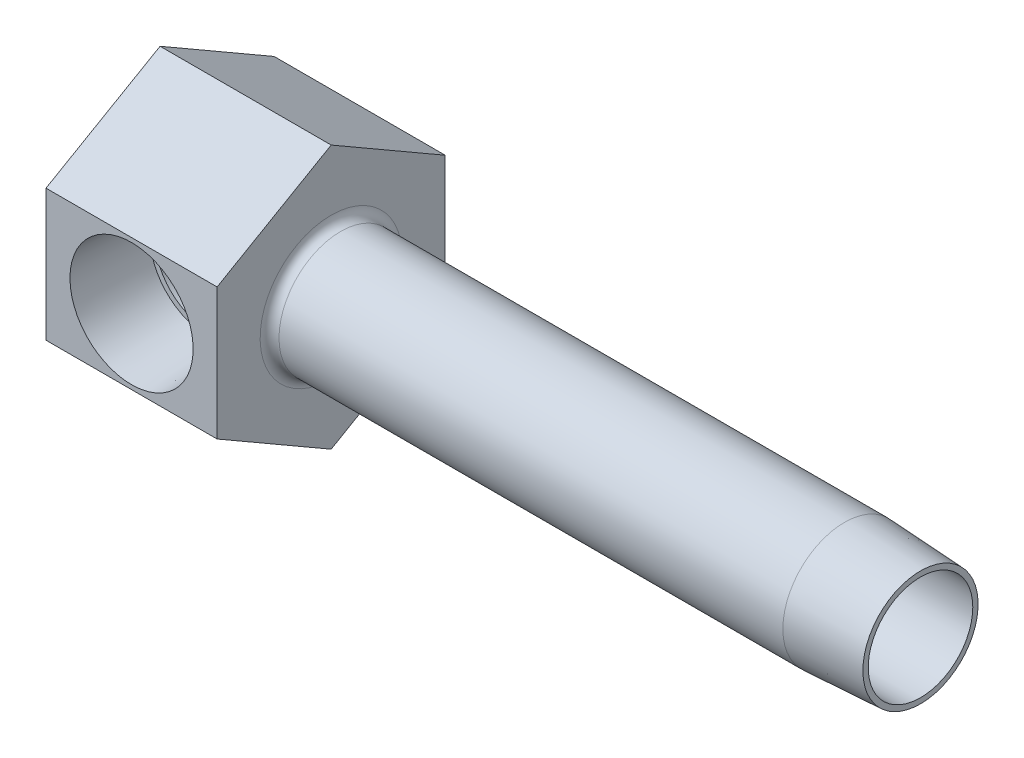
ISO-10303-21;
HEADER;
FILE_DESCRIPTION(('STEP AP214'),'2;1');
FILE_NAME('part.step','',(''),(''),'','','');
FILE_SCHEMA(('AUTOMOTIVE_DESIGN { 1 0 10303 214 1 1 1 1 }'));
ENDSEC;
DATA;
#1=APPLICATION_CONTEXT('core data for automotive mechanical design processes');
#2=APPLICATION_PROTOCOL_DEFINITION('international standard','automotive_design',2000,#1);
#3=PRODUCT_CONTEXT('',#1,'mechanical');
#4=PRODUCT('Part','Part','',(#3));
#5=PRODUCT_RELATED_PRODUCT_CATEGORY('part','',(#4));
#6=PRODUCT_DEFINITION_FORMATION('','',#4);
#7=PRODUCT_DEFINITION_CONTEXT('part definition',#1,'design');
#8=PRODUCT_DEFINITION('design','',#6,#7);
#9=PRODUCT_DEFINITION_SHAPE('','',#8);
#10=(LENGTH_UNIT() NAMED_UNIT(*) SI_UNIT(.MILLI.,.METRE.));
#11=(NAMED_UNIT(*) PLANE_ANGLE_UNIT() SI_UNIT($,.RADIAN.));
#12=(NAMED_UNIT(*) SI_UNIT($,.STERADIAN.) SOLID_ANGLE_UNIT());
#13=UNCERTAINTY_MEASURE_WITH_UNIT(LENGTH_MEASURE(1.E-05),#10,'distance_accuracy_value','');
#14=(GEOMETRIC_REPRESENTATION_CONTEXT(3) GLOBAL_UNCERTAINTY_ASSIGNED_CONTEXT((#13)) GLOBAL_UNIT_ASSIGNED_CONTEXT((#10,
#11,#12)) REPRESENTATION_CONTEXT('',''));
#15=CARTESIAN_POINT('',(0.,0.,0.));
#16=DIRECTION('',(0.,0.,1.));
#17=DIRECTION('',(1.,0.,0.));
#18=AXIS2_PLACEMENT_3D('',#15,#16,#17);
#19=CARTESIAN_POINT('',(63.5,0.,4.71428939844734));
#20=DIRECTION('',(-1.,0.,0.));
#21=DIRECTION('',(0.,0.,1.));
#22=AXIS2_PLACEMENT_3D('',#19,#20,#21);
#23=PLANE('',#22);
#24=CARTESIAN_POINT('',(63.5,0.,9.525));
#25=DIRECTION('',(-1.,0.,0.));
#26=DIRECTION('',(0.,0.,1.));
#27=AXIS2_PLACEMENT_3D('',#24,#25,#26);
#28=CIRCLE('',#27,4.81071060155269);
#29=CARTESIAN_POINT('',(63.5,0.,14.3357106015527));
#30=VERTEX_POINT('',#29);
#31=EDGE_CURVE('E230',#30,#30,#28,.T.);
#32=ORIENTED_EDGE('',*,*,#31,.F.);
#33=EDGE_LOOP('',(#32));
#34=FACE_BOUND('',#33,.T.);
#35=CARTESIAN_POINT('',(63.5,0.,9.525));
#36=DIRECTION('',(1.,0.,0.));
#37=DIRECTION('',(0.,0.,-1.));
#38=AXIS2_PLACEMENT_3D('',#35,#36,#37);
#39=CIRCLE('',#38,4.365625);
#40=CARTESIAN_POINT('',(63.5,0.,5.159375));
#41=VERTEX_POINT('',#40);
#42=EDGE_CURVE('E133',#41,#41,#39,.T.);
#43=ORIENTED_EDGE('',*,*,#42,.F.);
#44=EDGE_LOOP('',(#43));
#45=FACE_BOUND('',#44,.T.);
#46=ADVANCED_FACE('F15',(#34,#45),#23,.F.);
#47=CARTESIAN_POINT('',(7.14375,0.,19.05));
#48=DIRECTION('',(0.,0.,1.));
#49=DIRECTION('',(1.,0.,0.));
#50=AXIS2_PLACEMENT_3D('',#47,#48,#49);
#51=CONICAL_SURFACE('',#50,5.1435,0.0523598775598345);
#52=CARTESIAN_POINT('',(7.14375,0.,19.05));
#53=DIRECTION('',(0.,0.,-1.));
#54=DIRECTION('',(-1.,0.,0.));
#55=AXIS2_PLACEMENT_3D('',#52,#53,#54);
#56=CIRCLE('',#55,5.1435);
#57=CARTESIAN_POINT('',(2.00025,0.,19.05));
#58=VERTEX_POINT('',#57);
#59=EDGE_CURVE('E290',#58,#58,#56,.T.);
#60=ORIENTED_EDGE('',*,*,#59,.F.);
#61=EDGE_LOOP('',(#60));
#62=FACE_BOUND('',#61,.T.);
#63=CARTESIAN_POINT('',(7.14375,0.,12.7000000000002));
#64=DIRECTION('',(0.,0.,-1.));
#65=DIRECTION('',(-1.,0.,0.));
#66=AXIS2_PLACEMENT_3D('',#63,#64,#65);
#67=CIRCLE('',#66,4.81071060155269);
#68=CARTESIAN_POINT('',(10.9073758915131,-2.99634054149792,12.7000000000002));
#69=VERTEX_POINT('',#68);
#70=CARTESIAN_POINT('',(10.9073758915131,2.99634054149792,12.7000000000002));
#71=VERTEX_POINT('',#70);
#72=EDGE_CURVE('E294',#69,#71,#67,.T.);
#73=ORIENTED_EDGE('',*,*,#72,.T.);
#74=CARTESIAN_POINT('',(10.9071937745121,2.99655245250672,12.6998000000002));
#75=CARTESIAN_POINT('',(10.971635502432,2.92155827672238,12.7705639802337));
#76=CARTESIAN_POINT('',(11.0345784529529,2.84341410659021,12.8393139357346));
#77=CARTESIAN_POINT('',(11.1569073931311,2.68056902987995,12.9723675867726));
#78=CARTESIAN_POINT('',(11.2162880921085,2.59585877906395,13.0366646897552));
#79=CARTESIAN_POINT('',(11.3887731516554,2.33059710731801,13.2228141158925));
#80=CARTESIAN_POINT('',(11.4952955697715,2.13996459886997,13.3369144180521));
#81=CARTESIAN_POINT('',(11.6670238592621,1.76978922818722,13.520146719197));
#82=CARTESIAN_POINT('',(11.7362081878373,1.59429861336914,13.5936668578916));
#83=CARTESIAN_POINT('',(11.8243838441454,1.32069459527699,13.6871793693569));
#84=CARTESIAN_POINT('',(11.8511557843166,1.22786736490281,13.7155347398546));
#85=CARTESIAN_POINT('',(11.8990876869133,1.0391950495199,13.7662595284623));
#86=CARTESIAN_POINT('',(11.9202500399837,0.943351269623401,13.7886314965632));
#87=CARTESIAN_POINT('',(11.9566990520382,0.748466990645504,13.8271421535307));
#88=CARTESIAN_POINT('',(11.971935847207,0.649406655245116,13.8432279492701));
#89=CARTESIAN_POINT('',(11.9959472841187,0.449682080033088,13.8685692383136));
#90=CARTESIAN_POINT('',(12.0047249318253,0.349018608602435,13.8778279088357));
#91=CARTESIAN_POINT('',(12.0156291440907,0.146869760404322,13.8893288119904));
#92=CARTESIAN_POINT('',(12.0177517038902,0.0453839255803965,13.8915668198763));
#93=CARTESIAN_POINT('',(12.0152840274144,-0.157407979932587,13.8889645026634));
#94=CARTESIAN_POINT('',(12.0106943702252,-0.258714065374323,13.8841247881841));
#95=CARTESIAN_POINT('',(11.9957865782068,-0.449057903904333,13.8683984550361));
#96=CARTESIAN_POINT('',(11.9861593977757,-0.538211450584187,13.8582411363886));
#97=CARTESIAN_POINT('',(11.961864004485,-0.715062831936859,13.8325939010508));
#98=CARTESIAN_POINT('',(11.9471941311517,-0.802760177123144,13.8171022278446));
#99=CARTESIAN_POINT('',(11.8959888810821,-1.06271154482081,13.762990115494));
#100=CARTESIAN_POINT('',(11.8522396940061,-1.23204639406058,13.7167134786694));
#101=CARTESIAN_POINT('',(11.7458224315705,-1.56656708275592,13.6038703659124));
#102=CARTESIAN_POINT('',(11.6823922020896,-1.73122409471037,13.5364852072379));
#103=CARTESIAN_POINT('',(11.5406571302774,-2.04618319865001,13.3853583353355));
#104=CARTESIAN_POINT('',(11.4623317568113,-2.19646504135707,13.3015940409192));
#105=CARTESIAN_POINT('',(11.3067680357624,-2.45998630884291,13.1343941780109));
#106=CARTESIAN_POINT('',(11.2311482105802,-2.57539375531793,13.0528153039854));
#107=CARTESIAN_POINT('',(11.0735639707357,-2.79452635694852,12.8818550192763));
#108=CARTESIAN_POINT('',(10.9916301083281,-2.89830245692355,12.792510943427));
#109=CARTESIAN_POINT('',(10.9071937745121,-2.99655245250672,12.6998000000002));
#110=B_SPLINE_CURVE_WITH_KNOTS('',3,(#74,#75,#76,#77,#78,#79,#80,#81,#82,#83,#84,#85,#86,#87,
#88,#89,#90,#91,#92,#93,#94,#95,#96,#97,#98,#99,#100,#101,#102,#103,#104,#105,#106,#107,#108,
#109),.UNSPECIFIED.,.F.,.F.,(4,2,2,2,2,2,2,2,2,2,2,2,2,2,2,2,2,4),(0.,0.364634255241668,
0.72979730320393,1.46525067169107,2.06997219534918,2.37170467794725,2.67330836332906,
2.97739780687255,3.28134564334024,3.58547634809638,3.88958081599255,4.15999530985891,
4.43049893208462,4.97084503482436,5.53548493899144,6.10090884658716,6.58103480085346,
7.05896806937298),.UNSPECIFIED.);
#111=EDGE_CURVE('E122',#71,#69,#110,.T.);
#112=ORIENTED_EDGE('',*,*,#111,.T.);
#113=EDGE_LOOP('',(#73,#112));
#114=FACE_BOUND('',#113,.T.);
#115=ADVANCED_FACE('F139',(#62,#114),#51,.F.);
#116=CARTESIAN_POINT('',(11.9544606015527,0.,12.7000000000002));
#117=DIRECTION('',(0.,0.,1.));
#118=DIRECTION('',(1.,0.,0.));
#119=AXIS2_PLACEMENT_3D('',#116,#117,#118);
#120=PLANE('',#119);
#121=ORIENTED_EDGE('',*,*,#72,.F.);
#122=DIRECTION('',(1.,0.,0.));
#123=VECTOR('',#122,1.);
#124=CARTESIAN_POINT('',(66.1375087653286,-2.99634054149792,12.7000000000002));
#125=LINE('',#124,#123);
#126=CARTESIAN_POINT('',(10.3187500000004,-2.99634054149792,12.7000000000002));
#127=VERTEX_POINT('',#126);
#128=EDGE_CURVE('E119',#69,#127,#125,.F.);
#129=ORIENTED_EDGE('',*,*,#128,.T.);
#130=CARTESIAN_POINT('',(7.14375,0.,12.7000000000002));
#131=DIRECTION('',(0.,0.,-1.));
#132=DIRECTION('',(-1.,0.,0.));
#133=AXIS2_PLACEMENT_3D('',#130,#131,#132);
#134=CIRCLE('',#133,4.36562500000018);
#135=CARTESIAN_POINT('',(10.3187500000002,2.99634054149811,12.7000000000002));
#136=VERTEX_POINT('',#135);
#137=EDGE_CURVE('E118',#127,#136,#134,.T.);
#138=ORIENTED_EDGE('',*,*,#137,.T.);
#139=DIRECTION('',(1.,0.,0.));
#140=VECTOR('',#139,1.);
#141=CARTESIAN_POINT('',(66.1375087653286,2.99634054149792,12.7000000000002));
#142=LINE('',#141,#140);
#143=EDGE_CURVE('E125',#136,#71,#142,.T.);
#144=ORIENTED_EDGE('',*,*,#143,.T.);
#145=EDGE_LOOP('',(#121,#129,#138,#144));
#146=FACE_BOUND('',#145,.T.);
#147=ADVANCED_FACE('F147',(#146),#120,.T.);
#148=CARTESIAN_POINT('',(7.14375,0.,35.9059426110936));
#149=DIRECTION('',(0.,0.,-1.));
#150=DIRECTION('',(-1.,0.,0.));
#151=AXIS2_PLACEMENT_3D('',#148,#149,#150);
#152=CYLINDRICAL_SURFACE('',#151,4.36562500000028);
#153=ORIENTED_EDGE('',*,*,#137,.F.);
#154=CARTESIAN_POINT('',(7.14375,0.,9.525));
#155=DIRECTION('',(0.707106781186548,0.,-0.707106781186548));
#156=DIRECTION('',(-0.707106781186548,0.,-0.707106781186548));
#157=AXIS2_PLACEMENT_3D('',#154,#155,#156);
#158=ELLIPSE('',#157,6.17392608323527,4.36562500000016);
#159=CARTESIAN_POINT('',(7.14375,-4.3656250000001,9.525));
#160=VERTEX_POINT('',#159);
#161=EDGE_CURVE('E104',#127,#160,#158,.T.);
#162=ORIENTED_EDGE('',*,*,#161,.T.);
#163=CARTESIAN_POINT('',(7.14375,0.,9.525));
#164=DIRECTION('',(-0.707106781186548,0.,-0.707106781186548));
#165=DIRECTION('',(0.707106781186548,0.,-0.707106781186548));
#166=AXIS2_PLACEMENT_3D('',#163,#164,#165);
#167=ELLIPSE('',#166,6.17392608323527,4.36562500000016);
#168=CARTESIAN_POINT('',(8.98888023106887,-3.95653586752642,7.67986976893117));
#169=VERTEX_POINT('',#168);
#170=EDGE_CURVE('E100',#160,#169,#167,.F.);
#171=ORIENTED_EDGE('',*,*,#170,.T.);
#172=CARTESIAN_POINT('',(7.14375,0.,7.67986976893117));
#173=DIRECTION('',(0.,0.,-1.));
#174=DIRECTION('',(-1.,0.,0.));
#175=AXIS2_PLACEMENT_3D('',#172,#173,#174);
#176=CIRCLE('',#175,4.36562500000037);
#177=CARTESIAN_POINT('',(8.98888023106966,3.95653586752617,7.67986976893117));
#178=VERTEX_POINT('',#177);
#179=EDGE_CURVE('E112',#169,#178,#176,.T.);
#180=ORIENTED_EDGE('',*,*,#179,.T.);
#181=CARTESIAN_POINT('',(7.14375,4.3656250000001,9.525));
#182=VERTEX_POINT('',#181);
#183=EDGE_CURVE('E30',#178,#182,#167,.F.);
#184=ORIENTED_EDGE('',*,*,#183,.T.);
#185=EDGE_CURVE('E121',#182,#136,#158,.T.);
#186=ORIENTED_EDGE('',*,*,#185,.T.);
#187=EDGE_LOOP('',(#153,#162,#171,#180,#184,#186));
#188=FACE_BOUND('',#187,.T.);
#189=ADVANCED_FACE('F115',(#188),#152,.F.);
#190=CARTESIAN_POINT('',(7.14375,0.,7.67986976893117));
#191=DIRECTION('',(0.,0.,1.));
#192=DIRECTION('',(1.,0.,0.));
#193=AXIS2_PLACEMENT_3D('',#190,#191,#192);
#194=CONICAL_SURFACE('',#193,4.36562500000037,1.0471975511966);
#195=ORIENTED_EDGE('',*,*,#179,.F.);
#196=CARTESIAN_POINT('',(8.9894997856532,-3.95662913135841,7.68006976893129));
#197=CARTESIAN_POINT('',(8.91497560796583,-3.94541760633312,7.6560189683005));
#198=CARTESIAN_POINT('',(8.84020256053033,-3.93428272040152,7.6327193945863));
#199=CARTESIAN_POINT('',(8.69001846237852,-3.91242782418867,7.58793860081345));
#200=CARTESIAN_POINT('',(8.61460714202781,-3.90170800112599,7.56645819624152));
#201=CARTESIAN_POINT('',(8.38848524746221,-3.87074056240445,7.50556917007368));
#202=CARTESIAN_POINT('',(8.2367287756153,-3.8515020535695,7.46932807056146));
#203=CARTESIAN_POINT('',(8.00667896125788,-3.82676825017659,7.42384959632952));
#204=CARTESIAN_POINT('',(7.92948623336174,-3.81920348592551,7.41015805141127));
#205=CARTESIAN_POINT('',(7.77441965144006,-3.80585437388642,7.38622945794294));
#206=CARTESIAN_POINT('',(7.69654594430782,-3.80006965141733,7.37599168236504));
#207=CARTESIAN_POINT('',(7.53967894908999,-3.79060206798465,7.35933225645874));
#208=CARTESIAN_POINT('',(7.46068163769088,-3.78693482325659,7.35293894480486));
#209=CARTESIAN_POINT('',(7.30231301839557,-3.7819879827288,7.34434534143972));
#210=CARTESIAN_POINT('',(7.2229414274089,-3.78071064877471,7.34214902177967));
#211=CARTESIAN_POINT('',(7.14355,-3.78074215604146,7.34218750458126));
#212=B_SPLINE_CURVE_WITH_KNOTS('',3,(#196,#197,#198,#199,#200,#201,#202,#203,#204,#205,#206,
#207,#208,#209,#210,#211),.UNSPECIFIED.,.F.,.F.,(4,2,2,2,2,2,2,4),(0.,0.237303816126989,
0.474713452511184,0.945835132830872,1.18204117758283,1.41819746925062,1.65607385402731,
1.89417525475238),.UNSPECIFIED.);
#213=CARTESIAN_POINT('',(7.14375,-3.78074215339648,7.34218750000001));
#214=VERTEX_POINT('',#213);
#215=EDGE_CURVE('E108',#169,#214,#212,.T.);
#216=ORIENTED_EDGE('',*,*,#215,.T.);
#217=DIRECTION('',(0.,0.866025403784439,-0.5));
#218=VECTOR('',#217,1.);
#219=CARTESIAN_POINT('',(7.14375,0.,5.159375));
#220=LINE('',#219,#218);
#221=CARTESIAN_POINT('',(7.14375,0.,5.159375));
#222=VERTEX_POINT('',#221);
#223=EDGE_CURVE('E275',#214,#222,#220,.T.);
#224=ORIENTED_EDGE('',*,*,#223,.T.);
#225=DIRECTION('',(0.,0.866025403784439,0.5));
#226=VECTOR('',#225,1.);
#227=CARTESIAN_POINT('',(7.14375,0.,5.159375));
#228=LINE('',#227,#226);
#229=CARTESIAN_POINT('',(7.14375,3.78074215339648,7.34218750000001));
#230=VERTEX_POINT('',#229);
#231=EDGE_CURVE('E258',#222,#230,#228,.T.);
#232=ORIENTED_EDGE('',*,*,#231,.T.);
#233=CARTESIAN_POINT('',(7.14355,3.78074215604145,7.34218750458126));
#234=CARTESIAN_POINT('',(7.20515303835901,3.78073202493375,7.34217451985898));
#235=CARTESIAN_POINT('',(7.26674694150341,3.78149280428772,7.34348695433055));
#236=CARTESIAN_POINT('',(7.38976236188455,3.78448017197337,7.34867189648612));
#237=CARTESIAN_POINT('',(7.45118394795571,3.78670605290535,7.3525431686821));
#238=CARTESIAN_POINT('',(7.63466542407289,3.79545033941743,7.36782927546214));
#239=CARTESIAN_POINT('',(7.75632841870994,3.80403629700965,7.38291749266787));
#240=CARTESIAN_POINT('',(8.11659337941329,3.83592256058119,7.44024735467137));
#241=CARTESIAN_POINT('',(8.35266311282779,3.8653919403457,7.49460284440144));
#242=CARTESIAN_POINT('',(8.65303625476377,3.90716169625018,7.57737916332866));
#243=CARTESIAN_POINT('',(8.72054620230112,3.91683509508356,7.59689306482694));
#244=CARTESIAN_POINT('',(8.855265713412,3.93652410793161,7.63741882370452));
#245=CARTESIAN_POINT('',(8.92247399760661,3.94654056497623,7.65843453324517));
#246=CARTESIAN_POINT('',(8.9894997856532,3.9566291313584,7.68006976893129));
#247=B_SPLINE_CURVE_WITH_KNOTS('',3,(#233,#234,#235,#236,#237,#238,#239,#240,#241,#242,#243,
#244,#245,#246),.UNSPECIFIED.,.F.,.F.,(4,2,2,2,2,2,4),(0.,0.184774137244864,0.369459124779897,
0.73767480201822,1.46761028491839,1.68043381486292,1.89382432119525),.UNSPECIFIED.);
#248=EDGE_CURVE('E251',#230,#178,#247,.T.);
#249=ORIENTED_EDGE('',*,*,#248,.T.);
#250=EDGE_LOOP('',(#195,#216,#224,#232,#249));
#251=FACE_BOUND('',#250,.T.);
#252=ADVANCED_FACE('F174',(#251),#194,.F.);
#253=CARTESIAN_POINT('',(14.2875,5.4992613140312,19.05));
#254=DIRECTION('',(0.,0.,-1.));
#255=DIRECTION('',(-1.,0.,0.));
#256=AXIS2_PLACEMENT_3D('',#253,#254,#255);
#257=PLANE('',#256);
#258=DIRECTION('',(0.,-1.,0.));
#259=VECTOR('',#258,1.);
#260=CARTESIAN_POINT('',(0.,5.4992613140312,19.05));
#261=LINE('',#260,#259);
#262=CARTESIAN_POINT('',(0.,5.4992613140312,19.05));
#263=VERTEX_POINT('',#262);
#264=CARTESIAN_POINT('',(0.,-5.49926131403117,19.05));
#265=VERTEX_POINT('',#264);
#266=EDGE_CURVE('E218',#263,#265,#261,.T.);
#267=ORIENTED_EDGE('',*,*,#266,.T.);
#268=DIRECTION('',(-1.,0.,0.));
#269=VECTOR('',#268,1.);
#270=CARTESIAN_POINT('',(14.2875,-5.49926131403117,19.05));
#271=LINE('',#270,#269);
#272=CARTESIAN_POINT('',(14.2875,-5.49926131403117,19.05));
#273=VERTEX_POINT('',#272);
#274=EDGE_CURVE('E243',#273,#265,#271,.T.);
#275=ORIENTED_EDGE('',*,*,#274,.F.);
#276=DIRECTION('',(0.,-1.,0.));
#277=VECTOR('',#276,1.);
#278=CARTESIAN_POINT('',(14.2875,5.4992613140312,19.05));
#279=LINE('',#278,#277);
#280=CARTESIAN_POINT('',(14.2875,5.4992613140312,19.05));
#281=VERTEX_POINT('',#280);
#282=EDGE_CURVE('E236',#281,#273,#279,.T.);
#283=ORIENTED_EDGE('',*,*,#282,.F.);
#284=DIRECTION('',(-1.,0.,0.));
#285=VECTOR('',#284,1.);
#286=CARTESIAN_POINT('',(14.2875,5.4992613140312,19.05));
#287=LINE('',#286,#285);
#288=EDGE_CURVE('E246',#281,#263,#287,.T.);
#289=ORIENTED_EDGE('',*,*,#288,.T.);
#290=EDGE_LOOP('',(#267,#275,#283,#289));
#291=FACE_BOUND('',#290,.T.);
#292=ORIENTED_EDGE('',*,*,#59,.T.);
#293=EDGE_LOOP('',(#292));
#294=FACE_BOUND('',#293,.T.);
#295=ADVANCED_FACE('F166',(#291,#294),#257,.F.);
#296=CARTESIAN_POINT('',(14.2875,-5.49926131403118,0.));
#297=DIRECTION('',(1.,0.,0.));
#298=DIRECTION('',(0.,1.,0.));
#299=AXIS2_PLACEMENT_3D('',#296,#297,#298);
#300=PLANE('',#299);
#301=CARTESIAN_POINT('',(14.2875,0.,9.525));
#302=DIRECTION('',(1.,0.,0.));
#303=DIRECTION('',(0.,1.,0.));
#304=AXIS2_PLACEMENT_3D('',#301,#302,#303);
#305=CIRCLE('',#304,5.9309);
#306=CARTESIAN_POINT('',(14.2875,5.9309,9.525));
#307=VERTEX_POINT('',#306);
#308=EDGE_CURVE('E23',#307,#307,#305,.F.);
#309=ORIENTED_EDGE('',*,*,#308,.T.);
#310=EDGE_LOOP('',(#309));
#311=FACE_BOUND('',#310,.T.);
#312=DIRECTION('',(0.,0.5,-0.866025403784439));
#313=VECTOR('',#312,1.);
#314=CARTESIAN_POINT('',(14.2875,-10.9985226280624,9.525));
#315=LINE('',#314,#313);
#316=CARTESIAN_POINT('',(14.2875,-10.9985226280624,9.525));
#317=VERTEX_POINT('',#316);
#318=CARTESIAN_POINT('',(14.2875,-5.49926131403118,0.));
#319=VERTEX_POINT('',#318);
#320=EDGE_CURVE('E227',#317,#319,#315,.T.);
#321=ORIENTED_EDGE('',*,*,#320,.T.);
#322=DIRECTION('',(0.,1.,0.));
#323=VECTOR('',#322,1.);
#324=CARTESIAN_POINT('',(14.2875,-5.49926131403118,0.));
#325=LINE('',#324,#323);
#326=CARTESIAN_POINT('',(14.2875,5.49926131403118,0.));
#327=VERTEX_POINT('',#326);
#328=EDGE_CURVE('E231',#319,#327,#325,.T.);
#329=ORIENTED_EDGE('',*,*,#328,.T.);
#330=DIRECTION('',(0.,0.5,0.866025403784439));
#331=VECTOR('',#330,1.);
#332=CARTESIAN_POINT('',(14.2875,5.49926131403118,0.));
#333=LINE('',#332,#331);
#334=CARTESIAN_POINT('',(14.2875,10.9985226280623,9.525));
#335=VERTEX_POINT('',#334);
#336=EDGE_CURVE('E207',#327,#335,#333,.T.);
#337=ORIENTED_EDGE('',*,*,#336,.T.);
#338=DIRECTION('',(0.,-0.5,0.86602540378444));
#339=VECTOR('',#338,1.);
#340=CARTESIAN_POINT('',(14.2875,10.9985226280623,9.525));
#341=LINE('',#340,#339);
#342=EDGE_CURVE('E234',#335,#281,#341,.T.);
#343=ORIENTED_EDGE('',*,*,#342,.T.);
#344=ORIENTED_EDGE('',*,*,#282,.T.);
#345=DIRECTION('',(0.,-0.5,-0.866025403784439));
#346=VECTOR('',#345,1.);
#347=CARTESIAN_POINT('',(14.2875,-5.49926131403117,19.05));
#348=LINE('',#347,#346);
#349=EDGE_CURVE('E38',#273,#317,#348,.T.);
#350=ORIENTED_EDGE('',*,*,#349,.T.);
#351=EDGE_LOOP('',(#321,#329,#337,#343,#344,#350));
#352=FACE_BOUND('',#351,.T.);
#353=ADVANCED_FACE('F163',(#311,#352),#300,.T.);
#354=CARTESIAN_POINT('',(14.2875,-10.9985226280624,9.525));
#355=DIRECTION('',(0.,0.866025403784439,0.5));
#356=DIRECTION('',(0.,-0.5,0.866025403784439));
#357=AXIS2_PLACEMENT_3D('',#354,#355,#356);
#358=PLANE('',#357);
#359=DIRECTION('',(0.,0.5,-0.866025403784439));
#360=VECTOR('',#359,1.);
#361=CARTESIAN_POINT('',(0.,-10.9985226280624,9.525));
#362=LINE('',#361,#360);
#363=CARTESIAN_POINT('',(0.,-10.9985226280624,9.525));
#364=VERTEX_POINT('',#363);
#365=CARTESIAN_POINT('',(0.,-5.49926131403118,0.));
#366=VERTEX_POINT('',#365);
#367=EDGE_CURVE('E203',#364,#366,#362,.T.);
#368=ORIENTED_EDGE('',*,*,#367,.T.);
#369=DIRECTION('',(-1.,0.,0.));
#370=VECTOR('',#369,1.);
#371=CARTESIAN_POINT('',(14.2875,-5.49926131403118,0.));
#372=LINE('',#371,#370);
#373=EDGE_CURVE('E197',#319,#366,#372,.T.);
#374=ORIENTED_EDGE('',*,*,#373,.F.);
#375=ORIENTED_EDGE('',*,*,#320,.F.);
#376=DIRECTION('',(-1.,0.,0.));
#377=VECTOR('',#376,1.);
#378=CARTESIAN_POINT('',(14.2875,-10.9985226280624,9.525));
#379=LINE('',#378,#377);
#380=EDGE_CURVE('E239',#317,#364,#379,.T.);
#381=ORIENTED_EDGE('',*,*,#380,.T.);
#382=EDGE_LOOP('',(#368,#374,#375,#381));
#383=FACE_BOUND('',#382,.T.);
#384=ADVANCED_FACE('F17',(#383),#358,.F.);
#385=CARTESIAN_POINT('',(14.2875,-5.49926131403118,0.));
#386=DIRECTION('',(0.,0.,1.));
#387=DIRECTION('',(0.,-1.,0.));
#388=AXIS2_PLACEMENT_3D('',#385,#386,#387);
#389=PLANE('',#388);
#390=DIRECTION('',(0.,1.,0.));
#391=VECTOR('',#390,1.);
#392=CARTESIAN_POINT('',(0.,-5.49926131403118,0.));
#393=LINE('',#392,#391);
#394=CARTESIAN_POINT('',(0.,5.49926131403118,0.));
#395=VERTEX_POINT('',#394);
#396=EDGE_CURVE('E192',#366,#395,#393,.T.);
#397=ORIENTED_EDGE('',*,*,#396,.T.);
#398=DIRECTION('',(-1.,0.,0.));
#399=VECTOR('',#398,1.);
#400=CARTESIAN_POINT('',(14.2875,5.49926131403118,0.));
#401=LINE('',#400,#399);
#402=EDGE_CURVE('E194',#327,#395,#401,.T.);
#403=ORIENTED_EDGE('',*,*,#402,.F.);
#404=ORIENTED_EDGE('',*,*,#328,.F.);
#405=ORIENTED_EDGE('',*,*,#373,.T.);
#406=EDGE_LOOP('',(#397,#403,#404,#405));
#407=FACE_BOUND('',#406,.T.);
#408=ADVANCED_FACE('F181',(#407),#389,.F.);
#409=CARTESIAN_POINT('',(14.2875,5.49926131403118,0.));
#410=DIRECTION('',(0.,-0.866025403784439,0.5));
#411=DIRECTION('',(0.,-0.5,-0.866025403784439));
#412=AXIS2_PLACEMENT_3D('',#409,#410,#411);
#413=PLANE('',#412);
#414=DIRECTION('',(0.,0.5,0.866025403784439));
#415=VECTOR('',#414,1.);
#416=CARTESIAN_POINT('',(0.,5.49926131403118,0.));
#417=LINE('',#416,#415);
#418=CARTESIAN_POINT('',(0.,10.9985226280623,9.525));
#419=VERTEX_POINT('',#418);
#420=EDGE_CURVE('E202',#395,#419,#417,.T.);
#421=ORIENTED_EDGE('',*,*,#420,.T.);
#422=DIRECTION('',(-1.,0.,0.));
#423=VECTOR('',#422,1.);
#424=CARTESIAN_POINT('',(14.2875,10.9985226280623,9.525));
#425=LINE('',#424,#423);
#426=EDGE_CURVE('E208',#335,#419,#425,.T.);
#427=ORIENTED_EDGE('',*,*,#426,.F.);
#428=ORIENTED_EDGE('',*,*,#336,.F.);
#429=ORIENTED_EDGE('',*,*,#402,.T.);
#430=EDGE_LOOP('',(#421,#427,#428,#429));
#431=FACE_BOUND('',#430,.T.);
#432=ADVANCED_FACE('F178',(#431),#413,.F.);
#433=CARTESIAN_POINT('',(14.2875,10.9985226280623,9.525));
#434=DIRECTION('',(0.,-0.86602540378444,-0.5));
#435=DIRECTION('',(0.,0.5,-0.86602540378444));
#436=AXIS2_PLACEMENT_3D('',#433,#434,#435);
#437=PLANE('',#436);
#438=DIRECTION('',(0.,-0.5,0.86602540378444));
#439=VECTOR('',#438,1.);
#440=CARTESIAN_POINT('',(0.,10.9985226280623,9.525));
#441=LINE('',#440,#439);
#442=EDGE_CURVE('E212',#419,#263,#441,.T.);
#443=ORIENTED_EDGE('',*,*,#442,.T.);
#444=ORIENTED_EDGE('',*,*,#288,.F.);
#445=ORIENTED_EDGE('',*,*,#342,.F.);
#446=ORIENTED_EDGE('',*,*,#426,.T.);
#447=EDGE_LOOP('',(#443,#444,#445,#446));
#448=FACE_BOUND('',#447,.T.);
#449=ADVANCED_FACE('F170',(#448),#437,.F.);
#450=CARTESIAN_POINT('',(14.2875,-5.49926131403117,19.05));
#451=DIRECTION('',(0.,0.866025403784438,-0.5));
#452=DIRECTION('',(0.,0.5,0.866025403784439));
#453=AXIS2_PLACEMENT_3D('',#450,#451,#452);
#454=PLANE('',#453);
#455=DIRECTION('',(0.,-0.5,-0.866025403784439));
#456=VECTOR('',#455,1.);
#457=CARTESIAN_POINT('',(0.,-5.49926131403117,19.05));
#458=LINE('',#457,#456);
#459=EDGE_CURVE('E224',#265,#364,#458,.T.);
#460=ORIENTED_EDGE('',*,*,#459,.T.);
#461=ORIENTED_EDGE('',*,*,#380,.F.);
#462=ORIENTED_EDGE('',*,*,#349,.F.);
#463=ORIENTED_EDGE('',*,*,#274,.T.);
#464=EDGE_LOOP('',(#460,#461,#462,#463));
#465=FACE_BOUND('',#464,.T.);
#466=ADVANCED_FACE('F161',(#465),#454,.F.);
#467=CARTESIAN_POINT('',(0.,-5.49926131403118,0.));
#468=DIRECTION('',(1.,0.,0.));
#469=DIRECTION('',(0.,1.,0.));
#470=AXIS2_PLACEMENT_3D('',#467,#468,#469);
#471=PLANE('',#470);
#472=ORIENTED_EDGE('',*,*,#367,.F.);
#473=ORIENTED_EDGE('',*,*,#459,.F.);
#474=ORIENTED_EDGE('',*,*,#266,.F.);
#475=ORIENTED_EDGE('',*,*,#442,.F.);
#476=ORIENTED_EDGE('',*,*,#420,.F.);
#477=ORIENTED_EDGE('',*,*,#396,.F.);
#478=EDGE_LOOP('',(#472,#473,#474,#475,#476,#477));
#479=FACE_BOUND('',#478,.T.);
#480=ADVANCED_FACE('F157',(#479),#471,.F.);
#481=CARTESIAN_POINT('',(68.0114010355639,0.,9.525));
#482=DIRECTION('',(-1.,0.,0.));
#483=DIRECTION('',(0.,0.,1.));
#484=AXIS2_PLACEMENT_3D('',#481,#482,#483);
#485=CYLINDRICAL_SURFACE('',#484,5.1435);
#486=CARTESIAN_POINT('',(15.0749,0.,9.525));
#487=DIRECTION('',(1.,0.,0.));
#488=DIRECTION('',(0.,1.,0.));
#489=AXIS2_PLACEMENT_3D('',#486,#487,#488);
#490=CIRCLE('',#489,5.1435);
#491=CARTESIAN_POINT('',(15.0749,5.1435,9.525));
#492=VERTEX_POINT('',#491);
#493=EDGE_CURVE('E10',#492,#492,#490,.T.);
#494=ORIENTED_EDGE('',*,*,#493,.T.);
#495=EDGE_LOOP('',(#494));
#496=FACE_BOUND('',#495,.T.);
#497=CARTESIAN_POINT('',(57.15,0.,9.525));
#498=DIRECTION('',(-1.,0.,0.));
#499=DIRECTION('',(0.,0.,1.));
#500=AXIS2_PLACEMENT_3D('',#497,#498,#499);
#501=CIRCLE('',#500,5.1435);
#502=CARTESIAN_POINT('',(57.15,0.,14.6685));
#503=VERTEX_POINT('',#502);
#504=EDGE_CURVE('E288',#503,#503,#501,.T.);
#505=ORIENTED_EDGE('',*,*,#504,.T.);
#506=EDGE_LOOP('',(#505));
#507=FACE_BOUND('',#506,.T.);
#508=ADVANCED_FACE('F154',(#496,#507),#485,.T.);
#509=CARTESIAN_POINT('',(63.5,0.,9.525));
#510=DIRECTION('',(-1.,0.,0.));
#511=DIRECTION('',(0.,0.,1.));
#512=AXIS2_PLACEMENT_3D('',#509,#510,#511);
#513=CONICAL_SURFACE('',#512,4.81071060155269,0.0523598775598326);
#514=ORIENTED_EDGE('',*,*,#504,.F.);
#515=EDGE_LOOP('',(#514));
#516=FACE_BOUND('',#515,.T.);
#517=ORIENTED_EDGE('',*,*,#31,.T.);
#518=EDGE_LOOP('',(#517));
#519=FACE_BOUND('',#518,.T.);
#520=ADVANCED_FACE('F153',(#516,#519),#513,.T.);
#521=CARTESIAN_POINT('',(7.14375,0.,9.525));
#522=DIRECTION('',(1.,0.,0.));
#523=DIRECTION('',(0.,0.,-1.));
#524=AXIS2_PLACEMENT_3D('',#521,#522,#523);
#525=PLANE('',#524);
#526=CARTESIAN_POINT('',(7.14375,0.,9.525));
#527=DIRECTION('',(1.,0.,0.));
#528=DIRECTION('',(0.,0.,-1.));
#529=AXIS2_PLACEMENT_3D('',#526,#527,#528);
#530=CIRCLE('',#529,4.365625);
#531=EDGE_CURVE('E129',#222,#230,#530,.T.);
#532=ORIENTED_EDGE('',*,*,#531,.T.);
#533=ORIENTED_EDGE('',*,*,#231,.F.);
#534=EDGE_LOOP('',(#532,#533));
#535=FACE_BOUND('',#534,.T.);
#536=ADVANCED_FACE('F320',(#535),#525,.T.);
#537=EDGE_CURVE('E127',#214,#222,#530,.T.);
#538=ORIENTED_EDGE('',*,*,#537,.T.);
#539=ORIENTED_EDGE('',*,*,#223,.F.);
#540=EDGE_LOOP('',(#538,#539));
#541=FACE_BOUND('',#540,.T.);
#542=ADVANCED_FACE('F267',(#541),#525,.T.);
#543=CARTESIAN_POINT('',(66.1375087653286,0.,9.525));
#544=DIRECTION('',(1.,0.,0.));
#545=DIRECTION('',(0.,0.,-1.));
#546=AXIS2_PLACEMENT_3D('',#543,#544,#545);
#547=CYLINDRICAL_SURFACE('',#546,4.365625);
#548=ORIENTED_EDGE('',*,*,#42,.T.);
#549=EDGE_LOOP('',(#548));
#550=FACE_BOUND('',#549,.T.);
#551=ORIENTED_EDGE('',*,*,#170,.F.);
#552=ORIENTED_EDGE('',*,*,#161,.F.);
#553=ORIENTED_EDGE('',*,*,#128,.F.);
#554=ORIENTED_EDGE('',*,*,#111,.F.);
#555=ORIENTED_EDGE('',*,*,#143,.F.);
#556=ORIENTED_EDGE('',*,*,#185,.F.);
#557=ORIENTED_EDGE('',*,*,#183,.F.);
#558=ORIENTED_EDGE('',*,*,#248,.F.);
#559=ORIENTED_EDGE('',*,*,#531,.F.);
#560=ORIENTED_EDGE('',*,*,#537,.F.);
#561=ORIENTED_EDGE('',*,*,#215,.F.);
#562=EDGE_LOOP('',(#551,#552,#553,#554,#555,#556,#557,#558,#559,#560,#561));
#563=FACE_BOUND('',#562,.T.);
#564=ADVANCED_FACE('F102',(#550,#563),#547,.F.);
#565=CARTESIAN_POINT('',(15.0749,0.,9.525));
#566=DIRECTION('',(1.,0.,0.));
#567=DIRECTION('',(0.,1.,0.));
#568=AXIS2_PLACEMENT_3D('',#565,#566,#567);
#569=TOROIDAL_SURFACE('',#568,5.9309,0.7874);
#570=ORIENTED_EDGE('',*,*,#493,.F.);
#571=EDGE_LOOP('',(#570));
#572=FACE_BOUND('',#571,.T.);
#573=ORIENTED_EDGE('',*,*,#308,.F.);
#574=EDGE_LOOP('',(#573));
#575=FACE_BOUND('',#574,.T.);
#576=ADVANCED_FACE('F266',(#572,#575),#569,.F.);
#577=CLOSED_SHELL('',(#46,#115,#147,#189,#252,#295,#353,#384,#408,#432,#449,#466,#480,#508,#520,
#536,#542,#564,#576));
#578=MANIFOLD_SOLID_BREP('B1',#577);
#579=ADVANCED_BREP_SHAPE_REPRESENTATION('',(#18,#578),#14);
#580=SHAPE_DEFINITION_REPRESENTATION(#9,#579);
ENDSEC;
END-ISO-10303-21;
